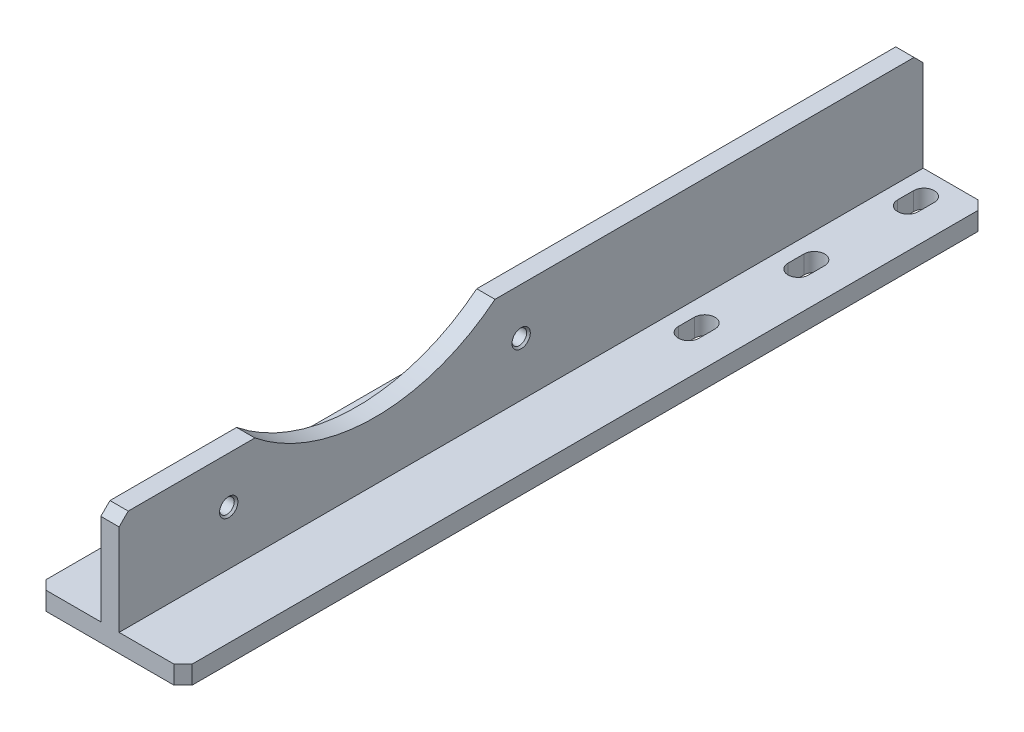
ISO-10303-21;
HEADER;
FILE_DESCRIPTION(('STEP AP214'),'2;1');
FILE_NAME('part.step','',(''),(''),'','','');
FILE_SCHEMA(('AUTOMOTIVE_DESIGN { 1 0 10303 214 1 1 1 1 }'));
ENDSEC;
DATA;
#1=APPLICATION_CONTEXT('core data for automotive mechanical design processes');
#2=APPLICATION_PROTOCOL_DEFINITION('international standard','automotive_design',2000,#1);
#3=PRODUCT_CONTEXT('',#1,'mechanical');
#4=PRODUCT('Part','Part','',(#3));
#5=PRODUCT_RELATED_PRODUCT_CATEGORY('part','',(#4));
#6=PRODUCT_DEFINITION_FORMATION('','',#4);
#7=PRODUCT_DEFINITION_CONTEXT('part definition',#1,'design');
#8=PRODUCT_DEFINITION('design','',#6,#7);
#9=PRODUCT_DEFINITION_SHAPE('','',#8);
#10=(LENGTH_UNIT() NAMED_UNIT(*) SI_UNIT(.MILLI.,.METRE.));
#11=(NAMED_UNIT(*) PLANE_ANGLE_UNIT() SI_UNIT($,.RADIAN.));
#12=(NAMED_UNIT(*) SI_UNIT($,.STERADIAN.) SOLID_ANGLE_UNIT());
#13=UNCERTAINTY_MEASURE_WITH_UNIT(LENGTH_MEASURE(1.E-05),#10,'distance_accuracy_value','');
#14=(GEOMETRIC_REPRESENTATION_CONTEXT(3) GLOBAL_UNCERTAINTY_ASSIGNED_CONTEXT((#13)) GLOBAL_UNIT_ASSIGNED_CONTEXT((#10,
#11,#12)) REPRESENTATION_CONTEXT('',''));
#15=CARTESIAN_POINT('',(0.,0.,0.));
#16=DIRECTION('',(0.,0.,1.));
#17=DIRECTION('',(1.,0.,0.));
#18=AXIS2_PLACEMENT_3D('',#15,#16,#17);
#19=CARTESIAN_POINT('',(0.,-12.7,0.));
#20=DIRECTION('',(0.,1.,0.));
#21=DIRECTION('',(0.,0.,1.));
#22=AXIS2_PLACEMENT_3D('',#19,#20,#21);
#23=PLANE('',#22);
#24=DIRECTION('',(-1.,0.,0.));
#25=VECTOR('',#24,1.);
#26=CARTESIAN_POINT('',(25.4,-12.7,9.08163038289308));
#27=LINE('',#26,#25);
#28=CARTESIAN_POINT('',(3.175,-12.7,9.08163038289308));
#29=VERTEX_POINT('',#28);
#30=CARTESIAN_POINT('',(-3.175,-12.7,9.08163038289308));
#31=VERTEX_POINT('',#30);
#32=EDGE_CURVE('E15',#29,#31,#27,.T.);
#33=ORIENTED_EDGE('',*,*,#32,.F.);
#34=DIRECTION('',(0.,0.,-1.));
#35=VECTOR('',#34,1.);
#36=CARTESIAN_POINT('',(3.175,-12.7,139.7));
#37=LINE('',#36,#35);
#38=CARTESIAN_POINT('',(3.175,-12.7,-136.525));
#39=VERTEX_POINT('',#38);
#40=EDGE_CURVE('E613',#29,#39,#37,.T.);
#41=ORIENTED_EDGE('',*,*,#40,.T.);
#42=DIRECTION('',(-1.,0.,0.));
#43=VECTOR('',#42,1.);
#44=CARTESIAN_POINT('',(0.,-12.7,-136.525));
#45=LINE('',#44,#43);
#46=CARTESIAN_POINT('',(-3.175,-12.7,-136.525));
#47=VERTEX_POINT('',#46);
#48=EDGE_CURVE('E471',#39,#47,#45,.T.);
#49=ORIENTED_EDGE('',*,*,#48,.T.);
#50=DIRECTION('',(0.,0.,1.));
#51=VECTOR('',#50,1.);
#52=CARTESIAN_POINT('',(-3.175,-12.7,-139.7));
#53=LINE('',#52,#51);
#54=EDGE_CURVE('E465',#47,#31,#53,.T.);
#55=ORIENTED_EDGE('',*,*,#54,.T.);
#56=EDGE_LOOP('',(#33,#41,#49,#55));
#57=FACE_BOUND('',#56,.T.);
#58=ADVANCED_FACE('F272',(#57),#23,.T.);
#59=CARTESIAN_POINT('',(3.175,0.,139.7));
#60=DIRECTION('',(-1.,0.,0.));
#61=DIRECTION('',(0.,-1.,0.));
#62=AXIS2_PLACEMENT_3D('',#59,#60,#61);
#63=PLANE('',#62);
#64=ORIENTED_EDGE('',*,*,#40,.F.);
#65=CARTESIAN_POINT('',(3.175,39.3108956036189,50.7999999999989));
#66=DIRECTION('',(-1.,0.,0.));
#67=DIRECTION('',(0.,-1.,0.));
#68=AXIS2_PLACEMENT_3D('',#65,#66,#67);
#69=CIRCLE('',#68,66.675);
#70=CARTESIAN_POINT('',(3.175,-12.7,92.5183696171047));
#71=VERTEX_POINT('',#70);
#72=EDGE_CURVE('E457',#29,#71,#69,.T.);
#73=ORIENTED_EDGE('',*,*,#72,.T.);
#74=CARTESIAN_POINT('',(3.175,-12.7,136.525));
#75=VERTEX_POINT('',#74);
#76=EDGE_CURVE('E476',#75,#71,#37,.T.);
#77=ORIENTED_EDGE('',*,*,#76,.F.);
#78=DIRECTION('',(0.,-0.707106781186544,0.707106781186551));
#79=VECTOR('',#78,1.);
#80=CARTESIAN_POINT('',(3.175,-12.7,136.525));
#81=LINE('',#80,#79);
#82=CARTESIAN_POINT('',(3.175,-15.875,139.7));
#83=VERTEX_POINT('',#82);
#84=EDGE_CURVE('E571',#75,#83,#81,.T.);
#85=ORIENTED_EDGE('',*,*,#84,.T.);
#86=DIRECTION('',(0.,1.,0.));
#87=VECTOR('',#86,1.);
#88=CARTESIAN_POINT('',(3.175,0.,139.7));
#89=LINE('',#88,#87);
#90=CARTESIAN_POINT('',(3.175,-47.625,139.7));
#91=VERTEX_POINT('',#90);
#92=EDGE_CURVE('E491',#91,#83,#89,.T.);
#93=ORIENTED_EDGE('',*,*,#92,.F.);
#94=DIRECTION('',(0.,0.,-1.));
#95=VECTOR('',#94,1.);
#96=CARTESIAN_POINT('',(3.175,-47.625,139.7));
#97=LINE('',#96,#95);
#98=CARTESIAN_POINT('',(3.175,-47.625,-139.7));
#99=VERTEX_POINT('',#98);
#100=EDGE_CURVE('E493',#91,#99,#97,.T.);
#101=ORIENTED_EDGE('',*,*,#100,.T.);
#102=DIRECTION('',(0.,1.,0.));
#103=VECTOR('',#102,1.);
#104=CARTESIAN_POINT('',(3.175,0.,-139.7));
#105=LINE('',#104,#103);
#106=CARTESIAN_POINT('',(3.175,-15.875,-139.7));
#107=VERTEX_POINT('',#106);
#108=EDGE_CURVE('E483',#99,#107,#105,.T.);
#109=ORIENTED_EDGE('',*,*,#108,.T.);
#110=DIRECTION('',(0.,-0.707106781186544,-0.707106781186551));
#111=VECTOR('',#110,1.);
#112=CARTESIAN_POINT('',(3.175,-12.7,-136.525));
#113=LINE('',#112,#111);
#114=EDGE_CURVE('E573',#107,#39,#113,.F.);
#115=ORIENTED_EDGE('',*,*,#114,.T.);
#116=EDGE_LOOP('',(#64,#73,#77,#85,#93,#101,#109,#115));
#117=FACE_BOUND('',#116,.T.);
#118=CARTESIAN_POINT('',(3.175,-28.9389043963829,-1.47798440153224E-12));
#119=DIRECTION('',(1.,0.,0.));
#120=DIRECTION('',(0.,0.,-1.));
#121=AXIS2_PLACEMENT_3D('',#118,#119,#120);
#122=CIRCLE('',#121,3.1877);
#123=CARTESIAN_POINT('',(3.175,-28.9389043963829,-3.18770000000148));
#124=VERTEX_POINT('',#123);
#125=EDGE_CURVE('E690',#124,#124,#122,.T.);
#126=ORIENTED_EDGE('',*,*,#125,.F.);
#127=EDGE_LOOP('',(#126));
#128=FACE_BOUND('',#127,.T.);
#129=CARTESIAN_POINT('',(3.175,-28.9389043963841,101.599999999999));
#130=DIRECTION('',(1.,0.,0.));
#131=DIRECTION('',(0.,0.,-1.));
#132=AXIS2_PLACEMENT_3D('',#129,#130,#131);
#133=CIRCLE('',#132,3.1877);
#134=CARTESIAN_POINT('',(3.175,-28.9389043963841,98.4122999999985));
#135=VERTEX_POINT('',#134);
#136=EDGE_CURVE('E614',#135,#135,#133,.T.);
#137=ORIENTED_EDGE('',*,*,#136,.F.);
#138=EDGE_LOOP('',(#137));
#139=FACE_BOUND('',#138,.T.);
#140=ADVANCED_FACE('F611',(#117,#128,#139),#63,.F.);
#141=CARTESIAN_POINT('',(3.175,-47.625,139.7));
#142=DIRECTION('',(0.,-1.,0.));
#143=DIRECTION('',(0.,0.,-1.));
#144=AXIS2_PLACEMENT_3D('',#141,#142,#143);
#145=PLANE('',#144);
#146=DIRECTION('',(-1.,0.,0.));
#147=VECTOR('',#146,1.);
#148=CARTESIAN_POINT('',(3.175,-47.625,139.7));
#149=LINE('',#148,#147);
#150=CARTESIAN_POINT('',(22.2249999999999,-47.625,139.7));
#151=VERTEX_POINT('',#150);
#152=EDGE_CURVE('E489',#151,#91,#149,.T.);
#153=ORIENTED_EDGE('',*,*,#152,.F.);
#154=DIRECTION('',(-0.707106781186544,0.,0.707106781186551));
#155=VECTOR('',#154,1.);
#156=CARTESIAN_POINT('',(22.2249999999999,-47.625,139.7));
#157=LINE('',#156,#155);
#158=CARTESIAN_POINT('',(25.4,-47.625,136.525));
#159=VERTEX_POINT('',#158);
#160=EDGE_CURVE('E602',#151,#159,#157,.F.);
#161=ORIENTED_EDGE('',*,*,#160,.T.);
#162=DIRECTION('',(0.,0.,-1.));
#163=VECTOR('',#162,1.);
#164=CARTESIAN_POINT('',(25.4,-47.625,139.7));
#165=LINE('',#164,#163);
#166=CARTESIAN_POINT('',(25.4,-47.625,-136.525));
#167=VERTEX_POINT('',#166);
#168=EDGE_CURVE('E506',#159,#167,#165,.T.);
#169=ORIENTED_EDGE('',*,*,#168,.T.);
#170=DIRECTION('',(-0.707106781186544,0.,-0.707106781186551));
#171=VECTOR('',#170,1.);
#172=CARTESIAN_POINT('',(25.4,-47.625,-136.525));
#173=LINE('',#172,#171);
#174=CARTESIAN_POINT('',(22.225,-47.625,-139.7));
#175=VERTEX_POINT('',#174);
#176=EDGE_CURVE('E294',#167,#175,#173,.T.);
#177=ORIENTED_EDGE('',*,*,#176,.T.);
#178=DIRECTION('',(-1.,0.,0.));
#179=VECTOR('',#178,1.);
#180=CARTESIAN_POINT('',(3.175,-47.625,-139.7));
#181=LINE('',#180,#179);
#182=EDGE_CURVE('E500',#175,#99,#181,.T.);
#183=ORIENTED_EDGE('',*,*,#182,.T.);
#184=ORIENTED_EDGE('',*,*,#100,.F.);
#185=EDGE_LOOP('',(#153,#161,#169,#177,#183,#184));
#186=FACE_BOUND('',#185,.T.);
#187=DIRECTION('',(0.,0.,-1.));
#188=VECTOR('',#187,1.);
#189=CARTESIAN_POINT('',(15.40764,-47.625,-49.54524));
#190=LINE('',#189,#188);
#191=CARTESIAN_POINT('',(15.40764,-47.625,-49.54524));
#192=VERTEX_POINT('',#191);
#193=CARTESIAN_POINT('',(15.40764,-47.625,-55.10276));
#194=VERTEX_POINT('',#193);
#195=EDGE_CURVE('E639',#192,#194,#190,.T.);
#196=ORIENTED_EDGE('',*,*,#195,.F.);
#197=CARTESIAN_POINT('',(11.8364,-47.625,-49.54524));
#198=DIRECTION('',(0.,1.,0.));
#199=DIRECTION('',(0.,0.,1.));
#200=AXIS2_PLACEMENT_3D('',#197,#198,#199);
#201=CIRCLE('',#200,3.57123999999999);
#202=CARTESIAN_POINT('',(8.26515999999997,-47.625,-49.54524));
#203=VERTEX_POINT('',#202);
#204=EDGE_CURVE('E631',#203,#192,#201,.T.);
#205=ORIENTED_EDGE('',*,*,#204,.F.);
#206=DIRECTION('',(0.,0.,-1.));
#207=VECTOR('',#206,1.);
#208=CARTESIAN_POINT('',(8.26516000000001,-47.625,-49.54524));
#209=LINE('',#208,#207);
#210=CARTESIAN_POINT('',(8.26516000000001,-47.625,-55.10276));
#211=VERTEX_POINT('',#210);
#212=EDGE_CURVE('E636',#203,#211,#209,.T.);
#213=ORIENTED_EDGE('',*,*,#212,.T.);
#214=CARTESIAN_POINT('',(11.8364,-47.625,-55.10276));
#215=DIRECTION('',(0.,1.,0.));
#216=DIRECTION('',(0.,0.,1.));
#217=AXIS2_PLACEMENT_3D('',#214,#215,#216);
#218=CIRCLE('',#217,3.57123999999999);
#219=EDGE_CURVE('E619',#194,#211,#218,.T.);
#220=ORIENTED_EDGE('',*,*,#219,.F.);
#221=EDGE_LOOP('',(#196,#205,#213,#220));
#222=FACE_BOUND('',#221,.T.);
#223=CARTESIAN_POINT('',(11.8364,-47.625,-87.64524));
#224=DIRECTION('',(0.,1.,0.));
#225=DIRECTION('',(0.,0.,1.));
#226=AXIS2_PLACEMENT_3D('',#223,#224,#225);
#227=CIRCLE('',#226,3.57123999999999);
#228=CARTESIAN_POINT('',(8.26515999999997,-47.625,-87.64524));
#229=VERTEX_POINT('',#228);
#230=CARTESIAN_POINT('',(15.40764,-47.625,-87.64524));
#231=VERTEX_POINT('',#230);
#232=EDGE_CURVE('E653',#229,#231,#227,.T.);
#233=ORIENTED_EDGE('',*,*,#232,.F.);
#234=DIRECTION('',(0.,0.,-1.));
#235=VECTOR('',#234,1.);
#236=CARTESIAN_POINT('',(8.26516000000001,-47.625,-87.64524));
#237=LINE('',#236,#235);
#238=CARTESIAN_POINT('',(8.26516000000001,-47.625,-93.2027599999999));
#239=VERTEX_POINT('',#238);
#240=EDGE_CURVE('E658',#229,#239,#237,.T.);
#241=ORIENTED_EDGE('',*,*,#240,.T.);
#242=CARTESIAN_POINT('',(11.8364,-47.625,-93.2027599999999));
#243=DIRECTION('',(0.,1.,0.));
#244=DIRECTION('',(0.,0.,1.));
#245=AXIS2_PLACEMENT_3D('',#242,#243,#244);
#246=CIRCLE('',#245,3.57123999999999);
#247=CARTESIAN_POINT('',(15.40764,-47.625,-93.2027599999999));
#248=VERTEX_POINT('',#247);
#249=EDGE_CURVE('E644',#248,#239,#246,.T.);
#250=ORIENTED_EDGE('',*,*,#249,.F.);
#251=DIRECTION('',(0.,0.,-1.));
#252=VECTOR('',#251,1.);
#253=CARTESIAN_POINT('',(15.40764,-47.625,-87.64524));
#254=LINE('',#253,#252);
#255=EDGE_CURVE('E661',#231,#248,#254,.T.);
#256=ORIENTED_EDGE('',*,*,#255,.F.);
#257=EDGE_LOOP('',(#233,#241,#250,#256));
#258=FACE_BOUND('',#257,.T.);
#259=DIRECTION('',(0.,0.,-1.));
#260=VECTOR('',#259,1.);
#261=CARTESIAN_POINT('',(15.40764,-47.625,-125.74524));
#262=LINE('',#261,#260);
#263=CARTESIAN_POINT('',(15.40764,-47.625,-125.74524));
#264=VERTEX_POINT('',#263);
#265=CARTESIAN_POINT('',(15.40764,-47.625,-131.30276));
#266=VERTEX_POINT('',#265);
#267=EDGE_CURVE('E681',#264,#266,#262,.T.);
#268=ORIENTED_EDGE('',*,*,#267,.F.);
#269=CARTESIAN_POINT('',(11.8364,-47.625,-125.74524));
#270=DIRECTION('',(0.,1.,0.));
#271=DIRECTION('',(0.,0.,1.));
#272=AXIS2_PLACEMENT_3D('',#269,#270,#271);
#273=CIRCLE('',#272,3.57123999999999);
#274=CARTESIAN_POINT('',(8.26516000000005,-47.625,-125.74524));
#275=VERTEX_POINT('',#274);
#276=EDGE_CURVE('E674',#275,#264,#273,.T.);
#277=ORIENTED_EDGE('',*,*,#276,.F.);
#278=DIRECTION('',(0.,0.,-1.));
#279=VECTOR('',#278,1.);
#280=CARTESIAN_POINT('',(8.26516000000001,-47.625,-125.74524));
#281=LINE('',#280,#279);
#282=CARTESIAN_POINT('',(8.26516000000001,-47.625,-131.30276));
#283=VERTEX_POINT('',#282);
#284=EDGE_CURVE('E678',#275,#283,#281,.T.);
#285=ORIENTED_EDGE('',*,*,#284,.T.);
#286=CARTESIAN_POINT('',(11.8364,-47.625,-131.30276));
#287=DIRECTION('',(0.,1.,0.));
#288=DIRECTION('',(0.,0.,1.));
#289=AXIS2_PLACEMENT_3D('',#286,#287,#288);
#290=CIRCLE('',#289,3.57123999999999);
#291=EDGE_CURVE('E665',#266,#283,#290,.T.);
#292=ORIENTED_EDGE('',*,*,#291,.F.);
#293=EDGE_LOOP('',(#268,#277,#285,#292));
#294=FACE_BOUND('',#293,.T.);
#295=ADVANCED_FACE('F705',(#186,#222,#258,#294),#145,.F.);
#296=CARTESIAN_POINT('',(-3.175,0.,139.7));
#297=DIRECTION('',(1.,0.,0.));
#298=DIRECTION('',(0.,1.,0.));
#299=AXIS2_PLACEMENT_3D('',#296,#297,#298);
#300=PLANE('',#299);
#301=CARTESIAN_POINT('',(-3.175,-28.9389043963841,101.599999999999));
#302=DIRECTION('',(1.,0.,0.));
#303=DIRECTION('',(0.,1.,0.));
#304=AXIS2_PLACEMENT_3D('',#301,#302,#303);
#305=CIRCLE('',#304,2.5527);
#306=CARTESIAN_POINT('',(-3.175,-26.3862043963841,101.599999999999));
#307=VERTEX_POINT('',#306);
#308=EDGE_CURVE('E693',#307,#307,#305,.T.);
#309=ORIENTED_EDGE('',*,*,#308,.T.);
#310=EDGE_LOOP('',(#309));
#311=FACE_BOUND('',#310,.T.);
#312=CARTESIAN_POINT('',(-3.175,-28.9389043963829,-1.47798440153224E-12));
#313=DIRECTION('',(1.,0.,0.));
#314=DIRECTION('',(0.,1.,0.));
#315=AXIS2_PLACEMENT_3D('',#312,#313,#314);
#316=CIRCLE('',#315,2.5527);
#317=CARTESIAN_POINT('',(-3.175,-26.3862043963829,-1.47798440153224E-12));
#318=VERTEX_POINT('',#317);
#319=EDGE_CURVE('E684',#318,#318,#316,.T.);
#320=ORIENTED_EDGE('',*,*,#319,.T.);
#321=EDGE_LOOP('',(#320));
#322=FACE_BOUND('',#321,.T.);
#323=CARTESIAN_POINT('',(-3.175,-12.7,92.5183696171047));
#324=VERTEX_POINT('',#323);
#325=CARTESIAN_POINT('',(-3.175,-12.7,136.525));
#326=VERTEX_POINT('',#325);
#327=EDGE_CURVE('E467',#324,#326,#53,.T.);
#328=ORIENTED_EDGE('',*,*,#327,.F.);
#329=CARTESIAN_POINT('',(-3.175,39.3108956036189,50.7999999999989));
#330=DIRECTION('',(-1.,0.,0.));
#331=DIRECTION('',(0.,-1.,0.));
#332=AXIS2_PLACEMENT_3D('',#329,#330,#331);
#333=CIRCLE('',#332,66.675);
#334=EDGE_CURVE('E286',#31,#324,#333,.T.);
#335=ORIENTED_EDGE('',*,*,#334,.F.);
#336=ORIENTED_EDGE('',*,*,#54,.F.);
#337=DIRECTION('',(0.,0.707106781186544,0.707106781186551));
#338=VECTOR('',#337,1.);
#339=CARTESIAN_POINT('',(-3.175,-12.7,-136.525));
#340=LINE('',#339,#338);
#341=CARTESIAN_POINT('',(-3.175,-15.875,-139.7));
#342=VERTEX_POINT('',#341);
#343=EDGE_CURVE('E563',#47,#342,#340,.F.);
#344=ORIENTED_EDGE('',*,*,#343,.T.);
#345=DIRECTION('',(0.,-1.,0.));
#346=VECTOR('',#345,1.);
#347=CARTESIAN_POINT('',(-3.175,0.,-139.7));
#348=LINE('',#347,#346);
#349=CARTESIAN_POINT('',(-3.175,-47.625,-139.7));
#350=VERTEX_POINT('',#349);
#351=EDGE_CURVE('E472',#342,#350,#348,.T.);
#352=ORIENTED_EDGE('',*,*,#351,.T.);
#353=DIRECTION('',(0.,0.,-1.));
#354=VECTOR('',#353,1.);
#355=CARTESIAN_POINT('',(-3.175,-47.625,139.7));
#356=LINE('',#355,#354);
#357=CARTESIAN_POINT('',(-3.175,-47.625,139.7));
#358=VERTEX_POINT('',#357);
#359=EDGE_CURVE('E518',#358,#350,#356,.T.);
#360=ORIENTED_EDGE('',*,*,#359,.F.);
#361=DIRECTION('',(0.,-1.,0.));
#362=VECTOR('',#361,1.);
#363=CARTESIAN_POINT('',(-3.175,0.,139.7));
#364=LINE('',#363,#362);
#365=CARTESIAN_POINT('',(-3.175,-15.875,139.7));
#366=VERTEX_POINT('',#365);
#367=EDGE_CURVE('E480',#366,#358,#364,.T.);
#368=ORIENTED_EDGE('',*,*,#367,.F.);
#369=DIRECTION('',(0.,0.707106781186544,-0.707106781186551));
#370=VECTOR('',#369,1.);
#371=CARTESIAN_POINT('',(-3.175,-12.7,136.525));
#372=LINE('',#371,#370);
#373=EDGE_CURVE('E561',#366,#326,#372,.T.);
#374=ORIENTED_EDGE('',*,*,#373,.T.);
#375=EDGE_LOOP('',(#328,#335,#336,#344,#352,#360,#368,#374));
#376=FACE_BOUND('',#375,.T.);
#377=ADVANCED_FACE('F464',(#311,#322,#376),#300,.F.);
#378=CARTESIAN_POINT('',(0.,0.,139.7));
#379=DIRECTION('',(0.,0.,-1.));
#380=DIRECTION('',(-1.,0.,0.));
#381=AXIS2_PLACEMENT_3D('',#378,#379,#380);
#382=PLANE('',#381);
#383=ORIENTED_EDGE('',*,*,#92,.T.);
#384=DIRECTION('',(-1.,0.,0.));
#385=VECTOR('',#384,1.);
#386=CARTESIAN_POINT('',(-3.175,-15.875,139.7));
#387=LINE('',#386,#385);
#388=EDGE_CURVE('E582',#83,#366,#387,.T.);
#389=ORIENTED_EDGE('',*,*,#388,.T.);
#390=ORIENTED_EDGE('',*,*,#367,.T.);
#391=DIRECTION('',(-1.,0.,0.));
#392=VECTOR('',#391,1.);
#393=CARTESIAN_POINT('',(-25.4,-47.625,139.7));
#394=LINE('',#393,#392);
#395=CARTESIAN_POINT('',(-22.225,-47.625,139.7));
#396=VERTEX_POINT('',#395);
#397=EDGE_CURVE('E482',#358,#396,#394,.T.);
#398=ORIENTED_EDGE('',*,*,#397,.T.);
#399=DIRECTION('',(0.,-1.,0.));
#400=VECTOR('',#399,1.);
#401=CARTESIAN_POINT('',(-22.225,0.,139.7));
#402=LINE('',#401,#400);
#403=CARTESIAN_POINT('',(-22.225,-53.975,139.7));
#404=VERTEX_POINT('',#403);
#405=EDGE_CURVE('E579',#396,#404,#402,.T.);
#406=ORIENTED_EDGE('',*,*,#405,.T.);
#407=DIRECTION('',(1.,0.,0.));
#408=VECTOR('',#407,1.);
#409=CARTESIAN_POINT('',(-25.4,-53.975,139.7));
#410=LINE('',#409,#408);
#411=CARTESIAN_POINT('',(22.2249999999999,-53.975,139.7));
#412=VERTEX_POINT('',#411);
#413=EDGE_CURVE('E486',#404,#412,#410,.T.);
#414=ORIENTED_EDGE('',*,*,#413,.T.);
#415=DIRECTION('',(0.,1.,0.));
#416=VECTOR('',#415,1.);
#417=CARTESIAN_POINT('',(22.2249999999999,0.,139.7));
#418=LINE('',#417,#416);
#419=EDGE_CURVE('E576',#412,#151,#418,.T.);
#420=ORIENTED_EDGE('',*,*,#419,.T.);
#421=ORIENTED_EDGE('',*,*,#152,.T.);
#422=EDGE_LOOP('',(#383,#389,#390,#398,#406,#414,#420,#421));
#423=FACE_BOUND('',#422,.T.);
#424=ADVANCED_FACE('F736',(#423),#382,.F.);
#425=CARTESIAN_POINT('',(0.,0.,-139.7));
#426=DIRECTION('',(0.,0.,-1.));
#427=DIRECTION('',(-1.,0.,0.));
#428=AXIS2_PLACEMENT_3D('',#425,#426,#427);
#429=PLANE('',#428);
#430=ORIENTED_EDGE('',*,*,#351,.F.);
#431=DIRECTION('',(1.,0.,0.));
#432=VECTOR('',#431,1.);
#433=CARTESIAN_POINT('',(0.,-15.875,-139.7));
#434=LINE('',#433,#432);
#435=EDGE_CURVE('E569',#342,#107,#434,.T.);
#436=ORIENTED_EDGE('',*,*,#435,.T.);
#437=ORIENTED_EDGE('',*,*,#108,.F.);
#438=ORIENTED_EDGE('',*,*,#182,.F.);
#439=DIRECTION('',(0.,-1.,0.));
#440=VECTOR('',#439,1.);
#441=CARTESIAN_POINT('',(22.225,-53.975,-139.7));
#442=LINE('',#441,#440);
#443=CARTESIAN_POINT('',(22.225,-53.975,-139.7));
#444=VERTEX_POINT('',#443);
#445=EDGE_CURVE('E565',#175,#444,#442,.T.);
#446=ORIENTED_EDGE('',*,*,#445,.T.);
#447=DIRECTION('',(1.,0.,0.));
#448=VECTOR('',#447,1.);
#449=CARTESIAN_POINT('',(-25.4,-53.975,-139.7));
#450=LINE('',#449,#448);
#451=CARTESIAN_POINT('',(-22.225,-53.975,-139.7));
#452=VERTEX_POINT('',#451);
#453=EDGE_CURVE('E497',#452,#444,#450,.T.);
#454=ORIENTED_EDGE('',*,*,#453,.F.);
#455=DIRECTION('',(0.,1.,0.));
#456=VECTOR('',#455,1.);
#457=CARTESIAN_POINT('',(-22.225,-47.625,-139.7));
#458=LINE('',#457,#456);
#459=CARTESIAN_POINT('',(-22.225,-47.625,-139.7));
#460=VERTEX_POINT('',#459);
#461=EDGE_CURVE('E567',#452,#460,#458,.T.);
#462=ORIENTED_EDGE('',*,*,#461,.T.);
#463=DIRECTION('',(-1.,0.,0.));
#464=VECTOR('',#463,1.);
#465=CARTESIAN_POINT('',(-25.4,-47.625,-139.7));
#466=LINE('',#465,#464);
#467=EDGE_CURVE('E474',#350,#460,#466,.T.);
#468=ORIENTED_EDGE('',*,*,#467,.F.);
#469=EDGE_LOOP('',(#430,#436,#437,#438,#446,#454,#462,#468));
#470=FACE_BOUND('',#469,.T.);
#471=ADVANCED_FACE('F715',(#470),#429,.T.);
#472=CARTESIAN_POINT('',(-25.4,-47.625,139.7));
#473=DIRECTION('',(0.,-1.,0.));
#474=DIRECTION('',(0.,0.,-1.));
#475=AXIS2_PLACEMENT_3D('',#472,#473,#474);
#476=PLANE('',#475);
#477=DIRECTION('',(0.,0.,-1.));
#478=VECTOR('',#477,1.);
#479=CARTESIAN_POINT('',(-25.4,-47.625,139.7));
#480=LINE('',#479,#478);
#481=CARTESIAN_POINT('',(-25.4,-47.625,136.525));
#482=VERTEX_POINT('',#481);
#483=CARTESIAN_POINT('',(-25.4,-47.625,-136.525));
#484=VERTEX_POINT('',#483);
#485=EDGE_CURVE('E515',#482,#484,#480,.T.);
#486=ORIENTED_EDGE('',*,*,#485,.F.);
#487=DIRECTION('',(-0.707106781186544,0.,-0.707106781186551));
#488=VECTOR('',#487,1.);
#489=CARTESIAN_POINT('',(-22.225,-47.625,139.7));
#490=LINE('',#489,#488);
#491=EDGE_CURVE('E599',#482,#396,#490,.F.);
#492=ORIENTED_EDGE('',*,*,#491,.T.);
#493=ORIENTED_EDGE('',*,*,#397,.F.);
#494=ORIENTED_EDGE('',*,*,#359,.T.);
#495=ORIENTED_EDGE('',*,*,#467,.T.);
#496=DIRECTION('',(-0.707106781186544,0.,0.707106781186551));
#497=VECTOR('',#496,1.);
#498=CARTESIAN_POINT('',(-25.4,-47.625,-136.525));
#499=LINE('',#498,#497);
#500=EDGE_CURVE('E597',#460,#484,#499,.T.);
#501=ORIENTED_EDGE('',*,*,#500,.T.);
#502=EDGE_LOOP('',(#486,#492,#493,#494,#495,#501));
#503=FACE_BOUND('',#502,.T.);
#504=ADVANCED_FACE('F729',(#503),#476,.F.);
#505=CARTESIAN_POINT('',(-25.4,-47.625,139.7));
#506=DIRECTION('',(1.,0.,0.));
#507=DIRECTION('',(0.,0.,-1.));
#508=AXIS2_PLACEMENT_3D('',#505,#506,#507);
#509=PLANE('',#508);
#510=DIRECTION('',(0.,0.,-1.));
#511=VECTOR('',#510,1.);
#512=CARTESIAN_POINT('',(-25.4,-53.975,139.7));
#513=LINE('',#512,#511);
#514=CARTESIAN_POINT('',(-25.4,-53.975,136.525));
#515=VERTEX_POINT('',#514);
#516=CARTESIAN_POINT('',(-25.4,-53.975,-136.525));
#517=VERTEX_POINT('',#516);
#518=EDGE_CURVE('E512',#515,#517,#513,.T.);
#519=ORIENTED_EDGE('',*,*,#518,.F.);
#520=DIRECTION('',(0.,1.,0.));
#521=VECTOR('',#520,1.);
#522=CARTESIAN_POINT('',(-25.4,-47.625,136.525));
#523=LINE('',#522,#521);
#524=EDGE_CURVE('E595',#515,#482,#523,.T.);
#525=ORIENTED_EDGE('',*,*,#524,.T.);
#526=ORIENTED_EDGE('',*,*,#485,.T.);
#527=DIRECTION('',(0.,-1.,0.));
#528=VECTOR('',#527,1.);
#529=CARTESIAN_POINT('',(-25.4,-53.975,-136.525));
#530=LINE('',#529,#528);
#531=EDGE_CURVE('E592',#484,#517,#530,.T.);
#532=ORIENTED_EDGE('',*,*,#531,.T.);
#533=EDGE_LOOP('',(#519,#525,#526,#532));
#534=FACE_BOUND('',#533,.T.);
#535=ADVANCED_FACE('F725',(#534),#509,.F.);
#536=CARTESIAN_POINT('',(-25.4,-53.975,139.7));
#537=DIRECTION('',(0.,1.,0.));
#538=DIRECTION('',(0.,0.,1.));
#539=AXIS2_PLACEMENT_3D('',#536,#537,#538);
#540=PLANE('',#539);
#541=CARTESIAN_POINT('',(11.8364,-53.975,-131.30276));
#542=DIRECTION('',(0.,1.,0.));
#543=DIRECTION('',(0.,0.,1.));
#544=AXIS2_PLACEMENT_3D('',#541,#542,#543);
#545=CIRCLE('',#544,3.57123999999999);
#546=CARTESIAN_POINT('',(15.40764,-53.975,-131.30276));
#547=VERTEX_POINT('',#546);
#548=CARTESIAN_POINT('',(8.26516000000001,-53.975,-131.30276));
#549=VERTEX_POINT('',#548);
#550=EDGE_CURVE('E551',#547,#549,#545,.T.);
#551=ORIENTED_EDGE('',*,*,#550,.T.);
#552=DIRECTION('',(0.,0.,1.));
#553=VECTOR('',#552,1.);
#554=CARTESIAN_POINT('',(8.26516000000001,-53.975,139.7));
#555=LINE('',#554,#553);
#556=CARTESIAN_POINT('',(8.26516000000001,-53.975,-125.74524));
#557=VERTEX_POINT('',#556);
#558=EDGE_CURVE('E554',#549,#557,#555,.T.);
#559=ORIENTED_EDGE('',*,*,#558,.T.);
#560=CARTESIAN_POINT('',(11.8364,-53.975,-125.74524));
#561=DIRECTION('',(0.,1.,0.));
#562=DIRECTION('',(0.,0.,1.));
#563=AXIS2_PLACEMENT_3D('',#560,#561,#562);
#564=CIRCLE('',#563,3.57123999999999);
#565=CARTESIAN_POINT('',(15.40764,-53.975,-125.74524));
#566=VERTEX_POINT('',#565);
#567=EDGE_CURVE('E548',#557,#566,#564,.T.);
#568=ORIENTED_EDGE('',*,*,#567,.T.);
#569=DIRECTION('',(0.,0.,-1.));
#570=VECTOR('',#569,1.);
#571=CARTESIAN_POINT('',(15.40764,-53.975,139.7));
#572=LINE('',#571,#570);
#573=EDGE_CURVE('E545',#566,#547,#572,.T.);
#574=ORIENTED_EDGE('',*,*,#573,.T.);
#575=EDGE_LOOP('',(#551,#559,#568,#574));
#576=FACE_BOUND('',#575,.T.);
#577=CARTESIAN_POINT('',(11.8364,-53.975,-93.2027599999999));
#578=DIRECTION('',(0.,1.,0.));
#579=DIRECTION('',(0.,0.,1.));
#580=AXIS2_PLACEMENT_3D('',#577,#578,#579);
#581=CIRCLE('',#580,3.57123999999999);
#582=CARTESIAN_POINT('',(15.40764,-53.975,-93.2027599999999));
#583=VERTEX_POINT('',#582);
#584=CARTESIAN_POINT('',(8.26516000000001,-53.975,-93.2027599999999));
#585=VERTEX_POINT('',#584);
#586=EDGE_CURVE('E539',#583,#585,#581,.T.);
#587=ORIENTED_EDGE('',*,*,#586,.T.);
#588=DIRECTION('',(0.,0.,1.));
#589=VECTOR('',#588,1.);
#590=CARTESIAN_POINT('',(8.26516000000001,-53.975,139.7));
#591=LINE('',#590,#589);
#592=CARTESIAN_POINT('',(8.26516000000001,-53.975,-87.64524));
#593=VERTEX_POINT('',#592);
#594=EDGE_CURVE('E542',#585,#593,#591,.T.);
#595=ORIENTED_EDGE('',*,*,#594,.T.);
#596=CARTESIAN_POINT('',(11.8364,-53.975,-87.64524));
#597=DIRECTION('',(0.,1.,0.));
#598=DIRECTION('',(0.,0.,1.));
#599=AXIS2_PLACEMENT_3D('',#596,#597,#598);
#600=CIRCLE('',#599,3.57123999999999);
#601=CARTESIAN_POINT('',(15.40764,-53.975,-87.64524));
#602=VERTEX_POINT('',#601);
#603=EDGE_CURVE('E536',#593,#602,#600,.T.);
#604=ORIENTED_EDGE('',*,*,#603,.T.);
#605=DIRECTION('',(0.,0.,-1.));
#606=VECTOR('',#605,1.);
#607=CARTESIAN_POINT('',(15.40764,-53.975,139.7));
#608=LINE('',#607,#606);
#609=EDGE_CURVE('E533',#602,#583,#608,.T.);
#610=ORIENTED_EDGE('',*,*,#609,.T.);
#611=EDGE_LOOP('',(#587,#595,#604,#610));
#612=FACE_BOUND('',#611,.T.);
#613=CARTESIAN_POINT('',(11.8364,-53.975,-55.10276));
#614=DIRECTION('',(0.,1.,0.));
#615=DIRECTION('',(0.,0.,1.));
#616=AXIS2_PLACEMENT_3D('',#613,#614,#615);
#617=CIRCLE('',#616,3.57123999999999);
#618=CARTESIAN_POINT('',(15.40764,-53.975,-55.10276));
#619=VERTEX_POINT('',#618);
#620=CARTESIAN_POINT('',(8.26516000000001,-53.975,-55.10276));
#621=VERTEX_POINT('',#620);
#622=EDGE_CURVE('E527',#619,#621,#617,.T.);
#623=ORIENTED_EDGE('',*,*,#622,.T.);
#624=DIRECTION('',(0.,0.,1.));
#625=VECTOR('',#624,1.);
#626=CARTESIAN_POINT('',(8.26516000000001,-53.975,139.7));
#627=LINE('',#626,#625);
#628=CARTESIAN_POINT('',(8.26516000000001,-53.975,-49.54524));
#629=VERTEX_POINT('',#628);
#630=EDGE_CURVE('E530',#621,#629,#627,.T.);
#631=ORIENTED_EDGE('',*,*,#630,.T.);
#632=CARTESIAN_POINT('',(11.8364,-53.975,-49.54524));
#633=DIRECTION('',(0.,1.,0.));
#634=DIRECTION('',(0.,0.,1.));
#635=AXIS2_PLACEMENT_3D('',#632,#633,#634);
#636=CIRCLE('',#635,3.57123999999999);
#637=CARTESIAN_POINT('',(15.40764,-53.975,-49.54524));
#638=VERTEX_POINT('',#637);
#639=EDGE_CURVE('E524',#629,#638,#636,.T.);
#640=ORIENTED_EDGE('',*,*,#639,.T.);
#641=DIRECTION('',(0.,0.,-1.));
#642=VECTOR('',#641,1.);
#643=CARTESIAN_POINT('',(15.40764,-53.975,139.7));
#644=LINE('',#643,#642);
#645=EDGE_CURVE('E521',#638,#619,#644,.T.);
#646=ORIENTED_EDGE('',*,*,#645,.T.);
#647=EDGE_LOOP('',(#623,#631,#640,#646));
#648=FACE_BOUND('',#647,.T.);
#649=ORIENTED_EDGE('',*,*,#413,.F.);
#650=DIRECTION('',(0.707106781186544,0.,0.707106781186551));
#651=VECTOR('',#650,1.);
#652=CARTESIAN_POINT('',(-22.225,-53.975,139.7));
#653=LINE('',#652,#651);
#654=EDGE_CURVE('E590',#404,#515,#653,.F.);
#655=ORIENTED_EDGE('',*,*,#654,.T.);
#656=ORIENTED_EDGE('',*,*,#518,.T.);
#657=DIRECTION('',(0.707106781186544,0.,-0.707106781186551));
#658=VECTOR('',#657,1.);
#659=CARTESIAN_POINT('',(-25.4,-53.975,-136.525));
#660=LINE('',#659,#658);
#661=EDGE_CURVE('E586',#517,#452,#660,.T.);
#662=ORIENTED_EDGE('',*,*,#661,.T.);
#663=ORIENTED_EDGE('',*,*,#453,.T.);
#664=DIRECTION('',(0.707106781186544,0.,0.707106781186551));
#665=VECTOR('',#664,1.);
#666=CARTESIAN_POINT('',(25.4,-53.975,-136.525));
#667=LINE('',#666,#665);
#668=CARTESIAN_POINT('',(25.4,-53.975,-136.525));
#669=VERTEX_POINT('',#668);
#670=EDGE_CURVE('E584',#444,#669,#667,.T.);
#671=ORIENTED_EDGE('',*,*,#670,.T.);
#672=DIRECTION('',(0.,0.,-1.));
#673=VECTOR('',#672,1.);
#674=CARTESIAN_POINT('',(25.4,-53.975,139.7));
#675=LINE('',#674,#673);
#676=CARTESIAN_POINT('',(25.4,-53.975,136.525));
#677=VERTEX_POINT('',#676);
#678=EDGE_CURVE('E509',#677,#669,#675,.T.);
#679=ORIENTED_EDGE('',*,*,#678,.F.);
#680=DIRECTION('',(0.707106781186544,0.,-0.707106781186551));
#681=VECTOR('',#680,1.);
#682=CARTESIAN_POINT('',(22.2249999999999,-53.975,139.7));
#683=LINE('',#682,#681);
#684=EDGE_CURVE('E588',#677,#412,#683,.F.);
#685=ORIENTED_EDGE('',*,*,#684,.T.);
#686=EDGE_LOOP('',(#649,#655,#656,#662,#663,#671,#679,#685));
#687=FACE_BOUND('',#686,.T.);
#688=ADVANCED_FACE('F721',(#576,#612,#648,#687),#540,.F.);
#689=CARTESIAN_POINT('',(25.4,-53.975,139.7));
#690=DIRECTION('',(-1.,0.,0.));
#691=DIRECTION('',(0.,0.,1.));
#692=AXIS2_PLACEMENT_3D('',#689,#690,#691);
#693=PLANE('',#692);
#694=ORIENTED_EDGE('',*,*,#168,.F.);
#695=DIRECTION('',(0.,-1.,0.));
#696=VECTOR('',#695,1.);
#697=CARTESIAN_POINT('',(25.4,-53.975,136.525));
#698=LINE('',#697,#696);
#699=EDGE_CURVE('E606',#159,#677,#698,.T.);
#700=ORIENTED_EDGE('',*,*,#699,.T.);
#701=ORIENTED_EDGE('',*,*,#678,.T.);
#702=DIRECTION('',(0.,1.,0.));
#703=VECTOR('',#702,1.);
#704=CARTESIAN_POINT('',(25.4,-47.625,-136.525));
#705=LINE('',#704,#703);
#706=EDGE_CURVE('E604',#669,#167,#705,.T.);
#707=ORIENTED_EDGE('',*,*,#706,.T.);
#708=EDGE_LOOP('',(#694,#700,#701,#707));
#709=FACE_BOUND('',#708,.T.);
#710=ADVANCED_FACE('F718',(#709),#693,.F.);
#711=DIRECTION('',(-1.,0.,0.));
#712=VECTOR('',#711,1.);
#713=CARTESIAN_POINT('',(25.4,-12.7,92.5183696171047));
#714=LINE('',#713,#712);
#715=EDGE_CURVE('E280',#324,#71,#714,.F.);
#716=ORIENTED_EDGE('',*,*,#715,.F.);
#717=ORIENTED_EDGE('',*,*,#327,.T.);
#718=DIRECTION('',(1.,0.,0.));
#719=VECTOR('',#718,1.);
#720=CARTESIAN_POINT('',(3.175,-12.7,136.525));
#721=LINE('',#720,#719);
#722=EDGE_CURVE('E557',#326,#75,#721,.T.);
#723=ORIENTED_EDGE('',*,*,#722,.T.);
#724=ORIENTED_EDGE('',*,*,#76,.T.);
#725=EDGE_LOOP('',(#716,#717,#723,#724));
#726=FACE_BOUND('',#725,.T.);
#727=ADVANCED_FACE('F616',(#726),#23,.T.);
#728=CARTESIAN_POINT('',(11.8364,-47.625,-55.10276));
#729=DIRECTION('',(0.,1.,0.));
#730=DIRECTION('',(0.,0.,1.));
#731=AXIS2_PLACEMENT_3D('',#728,#729,#730);
#732=CYLINDRICAL_SURFACE('',#731,3.57123999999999);
#733=DIRECTION('',(0.,-1.,0.));
#734=VECTOR('',#733,1.);
#735=CARTESIAN_POINT('',(15.40764,-53.976,-55.10276));
#736=LINE('',#735,#734);
#737=EDGE_CURVE('E623',#194,#619,#736,.T.);
#738=ORIENTED_EDGE('',*,*,#737,.F.);
#739=ORIENTED_EDGE('',*,*,#219,.T.);
#740=DIRECTION('',(0.,1.,0.));
#741=VECTOR('',#740,1.);
#742=CARTESIAN_POINT('',(8.26516000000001,-47.625,-55.10276));
#743=LINE('',#742,#741);
#744=EDGE_CURVE('E618',#621,#211,#743,.T.);
#745=ORIENTED_EDGE('',*,*,#744,.F.);
#746=ORIENTED_EDGE('',*,*,#622,.F.);
#747=EDGE_LOOP('',(#738,#739,#745,#746));
#748=FACE_BOUND('',#747,.T.);
#749=ADVANCED_FACE('F851',(#748),#732,.F.);
#750=CARTESIAN_POINT('',(11.8364,-47.625,-49.54524));
#751=DIRECTION('',(0.,1.,0.));
#752=DIRECTION('',(0.,0.,1.));
#753=AXIS2_PLACEMENT_3D('',#750,#751,#752);
#754=CYLINDRICAL_SURFACE('',#753,3.57123999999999);
#755=DIRECTION('',(0.,1.,0.));
#756=VECTOR('',#755,1.);
#757=CARTESIAN_POINT('',(8.26516000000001,-47.625,-49.54524));
#758=LINE('',#757,#756);
#759=EDGE_CURVE('E628',#203,#629,#758,.F.);
#760=ORIENTED_EDGE('',*,*,#759,.F.);
#761=ORIENTED_EDGE('',*,*,#204,.T.);
#762=DIRECTION('',(0.,-1.,0.));
#763=VECTOR('',#762,1.);
#764=CARTESIAN_POINT('',(15.40764,-53.976,-49.54524));
#765=LINE('',#764,#763);
#766=EDGE_CURVE('E633',#192,#638,#765,.T.);
#767=ORIENTED_EDGE('',*,*,#766,.T.);
#768=ORIENTED_EDGE('',*,*,#639,.F.);
#769=EDGE_LOOP('',(#760,#761,#767,#768));
#770=FACE_BOUND('',#769,.T.);
#771=ADVANCED_FACE('F848',(#770),#754,.F.);
#772=CARTESIAN_POINT('',(8.26516000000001,-47.625,-49.54524));
#773=DIRECTION('',(-1.,0.,0.));
#774=DIRECTION('',(0.,0.,1.));
#775=AXIS2_PLACEMENT_3D('',#772,#773,#774);
#776=PLANE('',#775);
#777=ORIENTED_EDGE('',*,*,#744,.T.);
#778=ORIENTED_EDGE('',*,*,#212,.F.);
#779=ORIENTED_EDGE('',*,*,#759,.T.);
#780=ORIENTED_EDGE('',*,*,#630,.F.);
#781=EDGE_LOOP('',(#777,#778,#779,#780));
#782=FACE_BOUND('',#781,.T.);
#783=ADVANCED_FACE('F844',(#782),#776,.F.);
#784=CARTESIAN_POINT('',(15.40764,-53.976,-49.54524));
#785=DIRECTION('',(1.,0.,0.));
#786=DIRECTION('',(0.,1.,0.));
#787=AXIS2_PLACEMENT_3D('',#784,#785,#786);
#788=PLANE('',#787);
#789=ORIENTED_EDGE('',*,*,#766,.F.);
#790=ORIENTED_EDGE('',*,*,#195,.T.);
#791=ORIENTED_EDGE('',*,*,#737,.T.);
#792=ORIENTED_EDGE('',*,*,#645,.F.);
#793=EDGE_LOOP('',(#789,#790,#791,#792));
#794=FACE_BOUND('',#793,.T.);
#795=ADVANCED_FACE('F840',(#794),#788,.F.);
#796=CARTESIAN_POINT('',(11.8364,-47.625,-93.2027599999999));
#797=DIRECTION('',(0.,1.,0.));
#798=DIRECTION('',(0.,0.,1.));
#799=AXIS2_PLACEMENT_3D('',#796,#797,#798);
#800=CYLINDRICAL_SURFACE('',#799,3.57123999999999);
#801=DIRECTION('',(0.,-1.,0.));
#802=VECTOR('',#801,1.);
#803=CARTESIAN_POINT('',(15.40764,-53.976,-93.2027599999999));
#804=LINE('',#803,#802);
#805=EDGE_CURVE('E647',#248,#583,#804,.T.);
#806=ORIENTED_EDGE('',*,*,#805,.F.);
#807=ORIENTED_EDGE('',*,*,#249,.T.);
#808=DIRECTION('',(0.,1.,0.));
#809=VECTOR('',#808,1.);
#810=CARTESIAN_POINT('',(8.26516000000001,-47.625,-93.2027599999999));
#811=LINE('',#810,#809);
#812=EDGE_CURVE('E642',#585,#239,#811,.T.);
#813=ORIENTED_EDGE('',*,*,#812,.F.);
#814=ORIENTED_EDGE('',*,*,#586,.F.);
#815=EDGE_LOOP('',(#806,#807,#813,#814));
#816=FACE_BOUND('',#815,.T.);
#817=ADVANCED_FACE('F836',(#816),#800,.F.);
#818=CARTESIAN_POINT('',(11.8364,-47.625,-87.64524));
#819=DIRECTION('',(0.,1.,0.));
#820=DIRECTION('',(0.,0.,1.));
#821=AXIS2_PLACEMENT_3D('',#818,#819,#820);
#822=CYLINDRICAL_SURFACE('',#821,3.57123999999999);
#823=DIRECTION('',(0.,1.,0.));
#824=VECTOR('',#823,1.);
#825=CARTESIAN_POINT('',(8.26516000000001,-47.625,-87.64524));
#826=LINE('',#825,#824);
#827=EDGE_CURVE('E650',#229,#593,#826,.F.);
#828=ORIENTED_EDGE('',*,*,#827,.F.);
#829=ORIENTED_EDGE('',*,*,#232,.T.);
#830=DIRECTION('',(0.,-1.,0.));
#831=VECTOR('',#830,1.);
#832=CARTESIAN_POINT('',(15.40764,-53.976,-87.64524));
#833=LINE('',#832,#831);
#834=EDGE_CURVE('E656',#231,#602,#833,.T.);
#835=ORIENTED_EDGE('',*,*,#834,.T.);
#836=ORIENTED_EDGE('',*,*,#603,.F.);
#837=EDGE_LOOP('',(#828,#829,#835,#836));
#838=FACE_BOUND('',#837,.T.);
#839=ADVANCED_FACE('F832',(#838),#822,.F.);
#840=CARTESIAN_POINT('',(8.26516000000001,-47.625,-87.64524));
#841=DIRECTION('',(-1.,0.,0.));
#842=DIRECTION('',(0.,0.,1.));
#843=AXIS2_PLACEMENT_3D('',#840,#841,#842);
#844=PLANE('',#843);
#845=ORIENTED_EDGE('',*,*,#812,.T.);
#846=ORIENTED_EDGE('',*,*,#240,.F.);
#847=ORIENTED_EDGE('',*,*,#827,.T.);
#848=ORIENTED_EDGE('',*,*,#594,.F.);
#849=EDGE_LOOP('',(#845,#846,#847,#848));
#850=FACE_BOUND('',#849,.T.);
#851=ADVANCED_FACE('F825',(#850),#844,.F.);
#852=CARTESIAN_POINT('',(15.40764,-53.976,-87.64524));
#853=DIRECTION('',(1.,0.,0.));
#854=DIRECTION('',(0.,1.,0.));
#855=AXIS2_PLACEMENT_3D('',#852,#853,#854);
#856=PLANE('',#855);
#857=ORIENTED_EDGE('',*,*,#834,.F.);
#858=ORIENTED_EDGE('',*,*,#255,.T.);
#859=ORIENTED_EDGE('',*,*,#805,.T.);
#860=ORIENTED_EDGE('',*,*,#609,.F.);
#861=EDGE_LOOP('',(#857,#858,#859,#860));
#862=FACE_BOUND('',#861,.T.);
#863=ADVANCED_FACE('F818',(#862),#856,.F.);
#864=CARTESIAN_POINT('',(11.8364,-47.625,-131.30276));
#865=DIRECTION('',(0.,1.,0.));
#866=DIRECTION('',(0.,0.,1.));
#867=AXIS2_PLACEMENT_3D('',#864,#865,#866);
#868=CYLINDRICAL_SURFACE('',#867,3.57123999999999);
#869=DIRECTION('',(0.,-1.,0.));
#870=VECTOR('',#869,1.);
#871=CARTESIAN_POINT('',(15.40764,-53.976,-131.30276));
#872=LINE('',#871,#870);
#873=EDGE_CURVE('E668',#266,#547,#872,.T.);
#874=ORIENTED_EDGE('',*,*,#873,.F.);
#875=ORIENTED_EDGE('',*,*,#291,.T.);
#876=DIRECTION('',(0.,1.,0.));
#877=VECTOR('',#876,1.);
#878=CARTESIAN_POINT('',(8.26516000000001,-47.625,-131.30276));
#879=LINE('',#878,#877);
#880=EDGE_CURVE('E663',#549,#283,#879,.T.);
#881=ORIENTED_EDGE('',*,*,#880,.F.);
#882=ORIENTED_EDGE('',*,*,#550,.F.);
#883=EDGE_LOOP('',(#874,#875,#881,#882));
#884=FACE_BOUND('',#883,.T.);
#885=ADVANCED_FACE('F816',(#884),#868,.F.);
#886=CARTESIAN_POINT('',(11.8364,-47.625,-125.74524));
#887=DIRECTION('',(0.,1.,0.));
#888=DIRECTION('',(0.,0.,1.));
#889=AXIS2_PLACEMENT_3D('',#886,#887,#888);
#890=CYLINDRICAL_SURFACE('',#889,3.57123999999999);
#891=DIRECTION('',(0.,1.,0.));
#892=VECTOR('',#891,1.);
#893=CARTESIAN_POINT('',(8.26516000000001,-47.625,-125.74524));
#894=LINE('',#893,#892);
#895=EDGE_CURVE('E671',#275,#557,#894,.F.);
#896=ORIENTED_EDGE('',*,*,#895,.F.);
#897=ORIENTED_EDGE('',*,*,#276,.T.);
#898=DIRECTION('',(0.,-1.,0.));
#899=VECTOR('',#898,1.);
#900=CARTESIAN_POINT('',(15.40764,-53.976,-125.74524));
#901=LINE('',#900,#899);
#902=EDGE_CURVE('E676',#264,#566,#901,.T.);
#903=ORIENTED_EDGE('',*,*,#902,.T.);
#904=ORIENTED_EDGE('',*,*,#567,.F.);
#905=EDGE_LOOP('',(#896,#897,#903,#904));
#906=FACE_BOUND('',#905,.T.);
#907=ADVANCED_FACE('F810',(#906),#890,.F.);
#908=CARTESIAN_POINT('',(8.26516000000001,-47.625,-125.74524));
#909=DIRECTION('',(-1.,0.,0.));
#910=DIRECTION('',(0.,0.,1.));
#911=AXIS2_PLACEMENT_3D('',#908,#909,#910);
#912=PLANE('',#911);
#913=ORIENTED_EDGE('',*,*,#880,.T.);
#914=ORIENTED_EDGE('',*,*,#284,.F.);
#915=ORIENTED_EDGE('',*,*,#895,.T.);
#916=ORIENTED_EDGE('',*,*,#558,.F.);
#917=EDGE_LOOP('',(#913,#914,#915,#916));
#918=FACE_BOUND('',#917,.T.);
#919=ADVANCED_FACE('F812',(#918),#912,.F.);
#920=CARTESIAN_POINT('',(15.40764,-53.976,-125.74524));
#921=DIRECTION('',(1.,0.,0.));
#922=DIRECTION('',(0.,1.,0.));
#923=AXIS2_PLACEMENT_3D('',#920,#921,#922);
#924=PLANE('',#923);
#925=ORIENTED_EDGE('',*,*,#902,.F.);
#926=ORIENTED_EDGE('',*,*,#267,.T.);
#927=ORIENTED_EDGE('',*,*,#873,.T.);
#928=ORIENTED_EDGE('',*,*,#573,.F.);
#929=EDGE_LOOP('',(#925,#926,#927,#928));
#930=FACE_BOUND('',#929,.T.);
#931=ADVANCED_FACE('F742',(#930),#924,.F.);
#932=CARTESIAN_POINT('',(0.,-12.7,-136.525));
#933=DIRECTION('',(0.,-0.707106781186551,0.707106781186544));
#934=DIRECTION('',(-1.,0.,0.));
#935=AXIS2_PLACEMENT_3D('',#932,#933,#934);
#936=PLANE('',#935);
#937=ORIENTED_EDGE('',*,*,#114,.F.);
#938=ORIENTED_EDGE('',*,*,#435,.F.);
#939=ORIENTED_EDGE('',*,*,#343,.F.);
#940=ORIENTED_EDGE('',*,*,#48,.F.);
#941=EDGE_LOOP('',(#937,#938,#939,#940));
#942=FACE_BOUND('',#941,.T.);
#943=ADVANCED_FACE('F738',(#942),#936,.F.);
#944=CARTESIAN_POINT('',(0.,-12.7,136.525));
#945=DIRECTION('',(0.,0.707106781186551,0.707106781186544));
#946=DIRECTION('',(-1.,0.,0.));
#947=AXIS2_PLACEMENT_3D('',#944,#945,#946);
#948=PLANE('',#947);
#949=ORIENTED_EDGE('',*,*,#373,.F.);
#950=ORIENTED_EDGE('',*,*,#388,.F.);
#951=ORIENTED_EDGE('',*,*,#84,.F.);
#952=ORIENTED_EDGE('',*,*,#722,.F.);
#953=EDGE_LOOP('',(#949,#950,#951,#952));
#954=FACE_BOUND('',#953,.T.);
#955=ADVANCED_FACE('F741',(#954),#948,.T.);
#956=CARTESIAN_POINT('',(-22.225,0.,139.7));
#957=DIRECTION('',(0.707106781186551,0.,-0.707106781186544));
#958=DIRECTION('',(0.,-1.,0.));
#959=AXIS2_PLACEMENT_3D('',#956,#957,#958);
#960=PLANE('',#959);
#961=ORIENTED_EDGE('',*,*,#491,.F.);
#962=ORIENTED_EDGE('',*,*,#524,.F.);
#963=ORIENTED_EDGE('',*,*,#654,.F.);
#964=ORIENTED_EDGE('',*,*,#405,.F.);
#965=EDGE_LOOP('',(#961,#962,#963,#964));
#966=FACE_BOUND('',#965,.T.);
#967=ADVANCED_FACE('F746',(#966),#960,.F.);
#968=CARTESIAN_POINT('',(22.2249999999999,0.,139.7));
#969=DIRECTION('',(-0.707106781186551,0.,-0.707106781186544));
#970=DIRECTION('',(0.,1.,0.));
#971=AXIS2_PLACEMENT_3D('',#968,#969,#970);
#972=PLANE('',#971);
#973=ORIENTED_EDGE('',*,*,#684,.F.);
#974=ORIENTED_EDGE('',*,*,#699,.F.);
#975=ORIENTED_EDGE('',*,*,#160,.F.);
#976=ORIENTED_EDGE('',*,*,#419,.F.);
#977=EDGE_LOOP('',(#973,#974,#975,#976));
#978=FACE_BOUND('',#977,.T.);
#979=ADVANCED_FACE('F750',(#978),#972,.F.);
#980=CARTESIAN_POINT('',(-25.4,-47.625,-136.525));
#981=DIRECTION('',(-0.707106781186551,0.,-0.707106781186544));
#982=DIRECTION('',(0.,1.,0.));
#983=AXIS2_PLACEMENT_3D('',#980,#981,#982);
#984=PLANE('',#983);
#985=ORIENTED_EDGE('',*,*,#500,.F.);
#986=ORIENTED_EDGE('',*,*,#461,.F.);
#987=ORIENTED_EDGE('',*,*,#661,.F.);
#988=ORIENTED_EDGE('',*,*,#531,.F.);
#989=EDGE_LOOP('',(#985,#986,#987,#988));
#990=FACE_BOUND('',#989,.T.);
#991=ADVANCED_FACE('F753',(#990),#984,.T.);
#992=CARTESIAN_POINT('',(25.4,-53.975,-136.525));
#993=DIRECTION('',(0.707106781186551,0.,-0.707106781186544));
#994=DIRECTION('',(0.,-1.,0.));
#995=AXIS2_PLACEMENT_3D('',#992,#993,#994);
#996=PLANE('',#995);
#997=ORIENTED_EDGE('',*,*,#670,.F.);
#998=ORIENTED_EDGE('',*,*,#445,.F.);
#999=ORIENTED_EDGE('',*,*,#176,.F.);
#1000=ORIENTED_EDGE('',*,*,#706,.F.);
#1001=EDGE_LOOP('',(#997,#998,#999,#1000));
#1002=FACE_BOUND('',#1001,.T.);
#1003=ADVANCED_FACE('F274',(#1002),#996,.T.);
#1004=CARTESIAN_POINT('',(3.175,-28.9389043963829,-1.47798440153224E-12));
#1005=DIRECTION('',(1.,0.,0.));
#1006=DIRECTION('',(0.,0.,-1.));
#1007=AXIS2_PLACEMENT_3D('',#1004,#1005,#1006);
#1008=CYLINDRICAL_SURFACE('',#1007,2.5527);
#1009=ORIENTED_EDGE('',*,*,#319,.F.);
#1010=EDGE_LOOP('',(#1009));
#1011=FACE_BOUND('',#1010,.T.);
#1012=CARTESIAN_POINT('',(2.54,-28.9389043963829,-1.47798440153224E-12));
#1013=DIRECTION('',(1.,0.,0.));
#1014=DIRECTION('',(0.,0.,-1.));
#1015=AXIS2_PLACEMENT_3D('',#1012,#1013,#1014);
#1016=CIRCLE('',#1015,2.5527);
#1017=CARTESIAN_POINT('',(2.54,-28.9389043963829,-2.55270000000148));
#1018=VERTEX_POINT('',#1017);
#1019=EDGE_CURVE('E687',#1018,#1018,#1016,.T.);
#1020=ORIENTED_EDGE('',*,*,#1019,.T.);
#1021=EDGE_LOOP('',(#1020));
#1022=FACE_BOUND('',#1021,.T.);
#1023=ADVANCED_FACE('F760',(#1011,#1022),#1008,.F.);
#1024=CARTESIAN_POINT('',(3.175,-28.9389043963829,-1.47798440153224E-12));
#1025=DIRECTION('',(1.,0.,0.));
#1026=DIRECTION('',(0.,0.,-1.));
#1027=AXIS2_PLACEMENT_3D('',#1024,#1025,#1026);
#1028=CONICAL_SURFACE('',#1027,3.1877,0.785398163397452);
#1029=ORIENTED_EDGE('',*,*,#1019,.F.);
#1030=EDGE_LOOP('',(#1029));
#1031=FACE_BOUND('',#1030,.T.);
#1032=ORIENTED_EDGE('',*,*,#125,.T.);
#1033=EDGE_LOOP('',(#1032));
#1034=FACE_BOUND('',#1033,.T.);
#1035=ADVANCED_FACE('F996',(#1031,#1034),#1028,.F.);
#1036=CARTESIAN_POINT('',(3.175,-28.9389043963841,101.599999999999));
#1037=DIRECTION('',(1.,0.,0.));
#1038=DIRECTION('',(0.,0.,-1.));
#1039=AXIS2_PLACEMENT_3D('',#1036,#1037,#1038);
#1040=CYLINDRICAL_SURFACE('',#1039,2.5527);
#1041=ORIENTED_EDGE('',*,*,#308,.F.);
#1042=EDGE_LOOP('',(#1041));
#1043=FACE_BOUND('',#1042,.T.);
#1044=CARTESIAN_POINT('',(2.54,-28.9389043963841,101.599999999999));
#1045=DIRECTION('',(1.,0.,0.));
#1046=DIRECTION('',(0.,0.,-1.));
#1047=AXIS2_PLACEMENT_3D('',#1044,#1045,#1046);
#1048=CIRCLE('',#1047,2.5527);
#1049=CARTESIAN_POINT('',(2.54,-28.9389043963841,99.0472999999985));
#1050=VERTEX_POINT('',#1049);
#1051=EDGE_CURVE('E696',#1050,#1050,#1048,.T.);
#1052=ORIENTED_EDGE('',*,*,#1051,.T.);
#1053=EDGE_LOOP('',(#1052));
#1054=FACE_BOUND('',#1053,.T.);
#1055=ADVANCED_FACE('F984',(#1043,#1054),#1040,.F.);
#1056=CARTESIAN_POINT('',(3.175,-28.9389043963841,101.599999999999));
#1057=DIRECTION('',(1.,0.,0.));
#1058=DIRECTION('',(0.,0.,-1.));
#1059=AXIS2_PLACEMENT_3D('',#1056,#1057,#1058);
#1060=CONICAL_SURFACE('',#1059,3.1877,0.785398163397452);
#1061=ORIENTED_EDGE('',*,*,#1051,.F.);
#1062=EDGE_LOOP('',(#1061));
#1063=FACE_BOUND('',#1062,.T.);
#1064=ORIENTED_EDGE('',*,*,#136,.T.);
#1065=EDGE_LOOP('',(#1064));
#1066=FACE_BOUND('',#1065,.T.);
#1067=ADVANCED_FACE('F702',(#1063,#1066),#1060,.F.);
#1068=CARTESIAN_POINT('',(25.4,39.3108956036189,50.7999999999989));
#1069=DIRECTION('',(-1.,0.,0.));
#1070=DIRECTION('',(0.,-1.,0.));
#1071=AXIS2_PLACEMENT_3D('',#1068,#1069,#1070);
#1072=CYLINDRICAL_SURFACE('',#1071,66.675);
#1073=ORIENTED_EDGE('',*,*,#32,.T.);
#1074=ORIENTED_EDGE('',*,*,#334,.T.);
#1075=ORIENTED_EDGE('',*,*,#715,.T.);
#1076=ORIENTED_EDGE('',*,*,#72,.F.);
#1077=EDGE_LOOP('',(#1073,#1074,#1075,#1076));
#1078=FACE_BOUND('',#1077,.T.);
#1079=ADVANCED_FACE('F455',(#1078),#1072,.F.);
#1080=CLOSED_SHELL('',(#58,#140,#295,#377,#424,#471,#504,#535,#688,#710,#727,#749,#771,#783,
#795,#817,#839,#851,#863,#885,#907,#919,#931,#943,#955,#967,#979,#991,#1003,#1023,#1035,#1055,
#1067,#1079));
#1081=MANIFOLD_SOLID_BREP('B2',#1080);
#1082=ADVANCED_BREP_SHAPE_REPRESENTATION('',(#18,#1081),#14);
#1083=SHAPE_DEFINITION_REPRESENTATION(#9,#1082);
ENDSEC;
END-ISO-10303-21;
